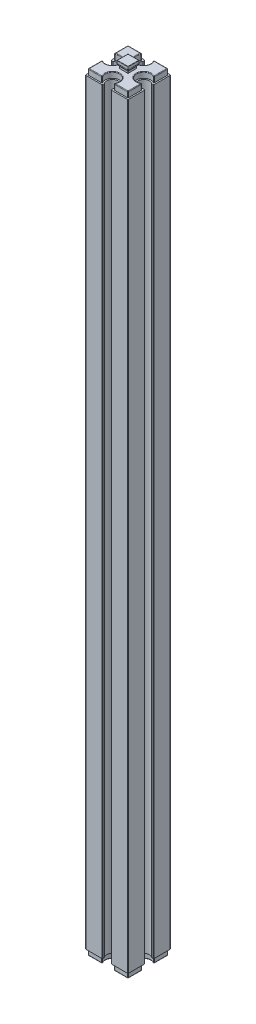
from build123d import *

# Parameters (mm, degrees)
EXTRUDE_1_DEPTH        = 133
EXTRUDE_2_DEPTH        = 2
EXTRUDE_3_DEPTH        = 2
FILLET_3_R             = 0.2
CUT_EXTRUDE_1_DEPTH    = 3
FILLET_4_R             = 0.2
FILLET_5_R             = 0.1
FILLET_3_OF_MIRROR_1_R = 0.2
FILLET_4_OF_MIRROR_1_R = 0.2
FILLET_5_OF_MIRROR_1_R = 0.1


with BuildPart() as part:
    # Sketch 1 → Extrude 1 (new body)
    with BuildSketch(Plane(origin=(0, 0, 0), x_dir=(1, 0, 0), z_dir=(0, 1, 0))):
        with BuildLine():
            Line((-7.5, 7.5), (-1.5, 7.5))
            Line((-1.5, 7.5), (-1.5, 6.822875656))
            ThreePointArc((-1.5, 6.822875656), (0, 3.5), (1.5, 6.822875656))
            Line((1.5, 6.822875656), (1.5, 7.5))
            Line((1.5, 7.5), (7.5, 7.5))
            Line((7.5, 7.5), (7.5, 1.5))
            Line((7.5, 1.5), (6.822875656, 1.5))
            ThreePointArc((6.822875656, 1.5), (3.5, 0), (6.822875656, -1.5))
            Line((6.822875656, -1.5), (7.5, -1.5))
            Line((7.5, -1.5), (7.5, -7.5))
            Line((7.5, -7.5), (1.5, -7.5))
            Line((1.5, -7.5), (1.5, -6.822875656))
            ThreePointArc((1.5, -6.822875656), (0, -3.5), (-1.5, -6.822875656))
            Line((-1.5, -6.822875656), (-1.5, -7.5))
            Line((-1.5, -7.5), (-7.5, -7.5))
            Line((-7.5, -7.5), (-7.5, -1.5))
            Line((-7.5, -1.5), (-6.822875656, -1.5))
            ThreePointArc((-6.822875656, -1.5), (-3.5, 0), (-6.822875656, 1.5))
            Line((-6.822875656, 1.5), (-7.5, 1.5))
            Line((-7.5, 1.5), (-7.5, 7.5))
        make_face()
    extrude_1 = extrude(amount=EXTRUDE_1_DEPTH)

    # Sketch 2 → Extrude 2 (add)
    with BuildSketch(Plane(origin=(0, 133, 0), x_dir=(1, 0, 0), z_dir=(0, 1, 0))):
        with BuildLine():
            Line((-7, 7), (-7, 2))
            ThreePointArc((-7, 2), (-3, 0), (-7, -2))
            Line((-7, -2), (-7, -7))
            Line((-7, -7), (-2, -7))
            ThreePointArc((-2, -7), (0, -3), (2, -7))
            Line((2, -7), (7, -7))
            Line((7, -7), (7, -2))
            ThreePointArc((7, -2), (3, 0), (7, 2))
            Line((7, 2), (7, 7))
            Line((7, 7), (2, 7))
            ThreePointArc((2, 7), (0, 3), (-2, 7))
            Line((-2, 7), (-7, 7))
        make_face()
    extrude_2 = extrude(amount=EXTRUDE_2_DEPTH)

    # Sketch 3 → Extrude 3 (add, symmetric)
    with BuildSketch(Plane(origin=(0, 0, 0), x_dir=(0, 0, -1), z_dir=(1, 0, 0))):
        with BuildLine():
            Line((-1.5, 135), (1.5, 135))
            Line((1.5, 135), (1.5, 135.677124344))
            ThreePointArc((1.5, 135.677124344), (1.780042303, 136.088161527), (1.95, 136.555590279))
            Line((1.95, 136.555590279), (1.95, 137.5))
            Line((1.95, 137.5), (-1.95, 137.5))
            Line((-1.95, 137.5), (-1.95, 136.555590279))
            ThreePointArc((-1.95, 136.555590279), (-1.780042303, 136.088161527), (-1.5, 135.677124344))
            Line((-1.5, 135.677124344), (-1.5, 135))
        make_face()
    extrude_3 = extrude(amount=EXTRUDE_3_DEPTH, both=True)

    # Fillet 3
    fillet_3_edges = [part.edges().sort_by_distance(p)[0] for p in [
        (-7.5, 66.5, -7.5),
        (-1.5, 66.5, -7.5),
        (1.5, 66.5, -7.5),
        (7.5, 66.5, -7.5),
        (7.5, 66.5, -1.5),
        (7.5, 66.5, 1.5),
        (7.5, 66.5, 7.5),
        (1.5, 66.5, 7.5),
        (-1.5, 66.5, 7.5),
        (-7.5, 66.5, 7.5),
        (-7.5, 66.5, 1.5),
        (-6.822875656, 66.5, -1.5),
        (-7.5, 66.5, -1.5),
    ]]
    fillet(fillet_3_edges, radius=FILLET_3_R)

    # Sketch 4 → Cut-Extrude 1 (cut, symmetric)
    with BuildSketch(Plane.XY):
        with BuildLine():
            Line((1.95, 137.5), (2, 137.5))
            Line((2, 137.5), (2, 135))
            Line((2, 135), (1.5, 135))
            Line((1.5, 135), (1.5, 135.677124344))
            ThreePointArc((1.5, 135.677124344), (1.780042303, 136.088161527), (1.95, 136.555590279))
            Line((1.95, 136.555590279), (1.95, 137.5))
        make_face()
        with BuildLine():
            Line((-1.95, 137.5), (-1.95, 136.555590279))
            ThreePointArc((-1.95, 136.555590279), (-1.780042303, 136.088161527), (-1.5, 135.677124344))
            Line((-1.5, 135.677124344), (-1.5, 135))
            Line((-1.5, 135), (-2, 135))
            Line((-2, 135), (-2, 137.5))
            Line((-2, 137.5), (-1.95, 137.5))
        make_face()
    cut_extrude_1 = extrude(amount=CUT_EXTRUDE_1_DEPTH, both=True, mode=Mode.SUBTRACT)

    # Fillet 4
    fillet_4_edges = [part.edges().sort_by_distance(p)[0] for p in [
        (-2, 134, -7),
        (-7, 134, -7),
        (-7, 134, -2),
        (-7, 134, 2),
        (-7, 134, 7),
        (-2, 134, 7),
        (2, 134, 7),
        (7, 134, 7),
        (7, 134, 2),
        (7, 134, -2),
        (7, 134, -7),
        (2, 134, -7),
        (-4.5, 135, -7),
        (-7, 135, -4.5),
        (-3, 135, 0),
        (-7, 135, 4.5),
        (-4.5, 135, 7),
        (0, 135, 3),
        (4.5, 135, 7),
        (7, 135, 4.5),
        (3, 135, 0),
        (7, 135, -4.5),
        (4.5, 135, -7),
        (0, 135, -3),
    ]]
    fillet(fillet_4_edges, radius=FILLET_4_R)

    # Fillet 5
    fillet_5_edges = [part.edges().sort_by_distance(p)[0] for p in [
        (1.95, 137.5, 0),
        (0, 137.5, -1.95),
        (0, 137.5, 1.95),
        (-1.95, 137.5, 0),
    ]]
    fillet(fillet_5_edges, radius=FILLET_5_R)

    # Mirror 1: Extrude 1, Extrude 2, Extrude 3, Cut-Extrude 1 across Top Plane
    add(extrude_1.mirror(Plane(origin=(0, 0, 0), x_dir=(1, 0, 0), z_dir=(0, 1, 0))))
    add(extrude_2.mirror(Plane(origin=(0, 0, 0), x_dir=(1, 0, 0), z_dir=(0, 1, 0))))
    add(extrude_3.mirror(Plane(origin=(0, 0, 0), x_dir=(1, 0, 0), z_dir=(0, 1, 0))))
    add(cut_extrude_1.mirror(Plane(origin=(0, 0, 0), x_dir=(1, 0, 0), z_dir=(0, 1, 0))), mode=Mode.SUBTRACT)

    # Fillet 3 of Mirror 1
    fillet_3_of_mirror_1_edges = [part.edges().sort_by_distance(p)[0] for p in [
        (-7.5, -66.5, -7.5),
        (-1.5, -66.5, -7.5),
        (1.5, -66.5, -7.5),
        (7.5, -66.5, -7.5),
        (7.5, -66.5, -1.5),
        (7.5, -66.5, 1.5),
        (7.5, -66.5, 7.5),
        (1.5, -66.5, 7.5),
        (-1.5, -66.5, 7.5),
        (-7.5, -66.5, 7.5),
        (-7.5, -66.5, 1.5),
        (-6.822875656, -66.5, -1.5),
        (-7.5, -66.5, -1.5),
    ]]
    fillet(fillet_3_of_mirror_1_edges, radius=FILLET_3_OF_MIRROR_1_R)

    # Fillet 4 of Mirror 1
    fillet_4_of_mirror_1_edges = [part.edges().sort_by_distance(p)[0] for p in [
        (-2, -134, -7),
        (-7, -134, -7),
        (-7, -134, -2),
        (-7, -134, 2),
        (-7, -134, 7),
        (-2, -134, 7),
        (2, -134, 7),
        (7, -134, 7),
        (7, -134, 2),
        (7, -134, -2),
        (7, -134, -7),
        (2, -134, -7),
        (-4.5, -135, -7),
        (-7, -135, -4.5),
        (-3, -135, 0),
        (-7, -135, 4.5),
        (-4.5, -135, 7),
        (0, -135, 3),
        (4.5, -135, 7),
        (7, -135, 4.5),
        (3, -135, 0),
        (7, -135, -4.5),
        (4.5, -135, -7),
        (0, -135, -3),
    ]]
    fillet(fillet_4_of_mirror_1_edges, radius=FILLET_4_OF_MIRROR_1_R)

    # Fillet 5 of Mirror 1
    fillet_5_of_mirror_1_edges = [part.edges().sort_by_distance(p)[0] for p in [
        (1.95, -137.5, 0),
        (0, -137.5, -1.95),
        (0, -137.5, 1.95),
        (-1.95, -137.5, 0),
    ]]
    fillet(fillet_5_of_mirror_1_edges, radius=FILLET_5_OF_MIRROR_1_R)


solid = part.part
